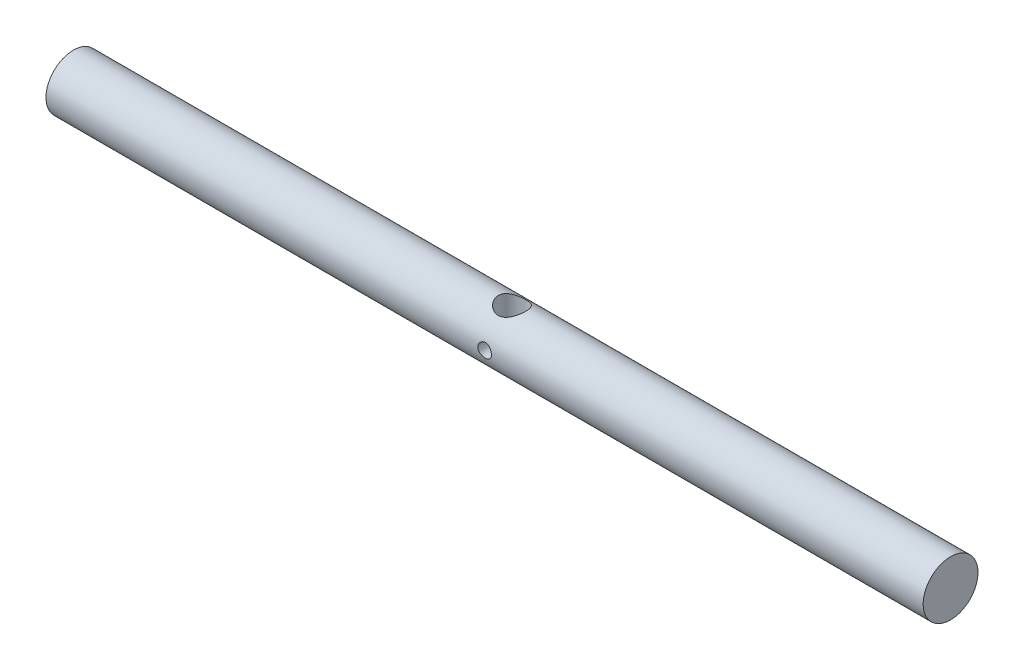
from build123d import *

# Parameters (mm, degrees)
EXTRUDE1_DEPTH          = 101.6
EXTRUDE1_DEPTH_BACK     = 101.6
SKETCH1_R               = 6.35
CUT_EXTRUDE1_DEPTH      = 102.996102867
CUT_EXTRUDE1_DEPTH_BACK = 102.996102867
SKETCH2_R               = 3.175
SKETCH3_R               = 1.5748
CUT_EXTRUDE2_DEPTH      = 7.54


with BuildPart() as part:
    # Sketch1 → Extrude1 (new, two sides: drawn at the far end of the back side and taken through both)
    with BuildSketch(Plane(origin=(0, 0, 0), x_dir=(0, 0, -1), z_dir=(1, 0, 0)).offset(-EXTRUDE1_DEPTH_BACK)):
        Circle(SKETCH1_R)
    extrude(amount=EXTRUDE1_DEPTH + EXTRUDE1_DEPTH_BACK)

    # Sketch2 → Cut-Extrude1 (cut, two sides: drawn at the far end of the back side and taken through both)
    with BuildSketch(Plane(origin=(0, 0, 0), x_dir=(1, 0, 0), z_dir=(0, 1, 0)).offset(-CUT_EXTRUDE1_DEPTH_BACK)):
        with Locations(Location((0, 0, 0), (0, 0, 270))):
            Circle(SKETCH2_R)
    extrude(amount=CUT_EXTRUDE1_DEPTH + CUT_EXTRUDE1_DEPTH_BACK, mode=Mode.SUBTRACT)

    # Sketch3 → Cut-Extrude2 (cut, symmetric)
    with BuildSketch(Plane.XY):
        Circle(SKETCH3_R)
    extrude(amount=CUT_EXTRUDE2_DEPTH, both=True, mode=Mode.SUBTRACT)


solid = part.part
